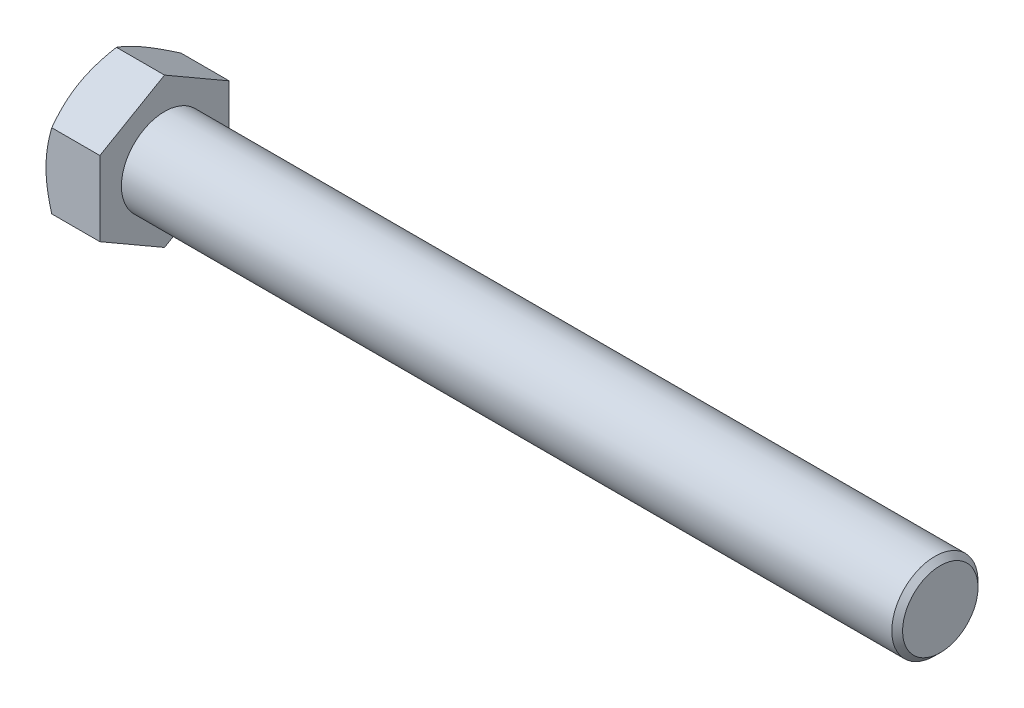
ISO-10303-21;
HEADER;
FILE_DESCRIPTION(('STEP AP214'),'2;1');
FILE_NAME('part.step','',(''),(''),'','','');
FILE_SCHEMA(('AUTOMOTIVE_DESIGN { 1 0 10303 214 1 1 1 1 }'));
ENDSEC;
DATA;
#1=APPLICATION_CONTEXT('core data for automotive mechanical design processes');
#2=APPLICATION_PROTOCOL_DEFINITION('international standard','automotive_design',2000,#1);
#3=PRODUCT_CONTEXT('',#1,'mechanical');
#4=PRODUCT('Part','Part','',(#3));
#5=PRODUCT_RELATED_PRODUCT_CATEGORY('part','',(#4));
#6=PRODUCT_DEFINITION_FORMATION('','',#4);
#7=PRODUCT_DEFINITION_CONTEXT('part definition',#1,'design');
#8=PRODUCT_DEFINITION('design','',#6,#7);
#9=PRODUCT_DEFINITION_SHAPE('','',#8);
#10=(LENGTH_UNIT() NAMED_UNIT(*) SI_UNIT(.MILLI.,.METRE.));
#11=(NAMED_UNIT(*) PLANE_ANGLE_UNIT() SI_UNIT($,.RADIAN.));
#12=(NAMED_UNIT(*) SI_UNIT($,.STERADIAN.) SOLID_ANGLE_UNIT());
#13=UNCERTAINTY_MEASURE_WITH_UNIT(LENGTH_MEASURE(1.E-05),#10,'distance_accuracy_value','');
#14=(GEOMETRIC_REPRESENTATION_CONTEXT(3) GLOBAL_UNCERTAINTY_ASSIGNED_CONTEXT((#13)) GLOBAL_UNIT_ASSIGNED_CONTEXT((#10,
#11,#12)) REPRESENTATION_CONTEXT('',''));
#15=CARTESIAN_POINT('',(0.,0.,0.));
#16=DIRECTION('',(0.,0.,1.));
#17=DIRECTION('',(1.,0.,0.));
#18=AXIS2_PLACEMENT_3D('',#15,#16,#17);
#19=CARTESIAN_POINT('',(180.,0.,0.));
#20=DIRECTION('',(-1.,0.,0.));
#21=DIRECTION('',(0.,0.,1.));
#22=AXIS2_PLACEMENT_3D('',#19,#20,#21);
#23=CYLINDRICAL_SURFACE('',#22,10.);
#24=CARTESIAN_POINT('',(178.75,0.,0.));
#25=DIRECTION('',(1.,0.,0.));
#26=DIRECTION('',(0.,0.,-1.));
#27=AXIS2_PLACEMENT_3D('',#24,#25,#26);
#28=CIRCLE('',#27,10.);
#29=CARTESIAN_POINT('',(178.75,0.,10.));
#30=VERTEX_POINT('',#29);
#31=EDGE_CURVE('E11',#30,#30,#28,.F.);
#32=CARTESIAN_POINT('',(0.,0.,0.));
#33=DIRECTION('',(-1.,0.,0.));
#34=DIRECTION('',(0.,0.,1.));
#35=AXIS2_PLACEMENT_3D('',#32,#33,#34);
#36=CIRCLE('',#35,10.);
#37=CARTESIAN_POINT('',(0.,0.,10.));
#38=VERTEX_POINT('',#37);
#39=EDGE_CURVE('E206',#38,#38,#36,.T.);
#40=CARTESIAN_POINT('',(178.75,0.,10.));
#41=CARTESIAN_POINT('',(176.888020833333,0.,10.));
#42=CARTESIAN_POINT('',(175.026041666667,0.,10.));
#43=CARTESIAN_POINT('',(171.302083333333,0.,10.));
#44=CARTESIAN_POINT('',(169.440104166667,0.,10.));
#45=CARTESIAN_POINT('',(165.716145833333,0.,10.));
#46=CARTESIAN_POINT('',(163.854166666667,0.,10.));
#47=CARTESIAN_POINT('',(160.130208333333,0.,10.));
#48=CARTESIAN_POINT('',(158.268229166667,0.,10.));
#49=CARTESIAN_POINT('',(154.544270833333,0.,10.));
#50=CARTESIAN_POINT('',(152.682291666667,0.,10.));
#51=CARTESIAN_POINT('',(148.958333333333,0.,10.));
#52=CARTESIAN_POINT('',(147.096354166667,0.,10.));
#53=CARTESIAN_POINT('',(143.372395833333,0.,10.));
#54=CARTESIAN_POINT('',(141.510416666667,0.,10.));
#55=CARTESIAN_POINT('',(137.786458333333,0.,10.));
#56=CARTESIAN_POINT('',(135.924479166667,0.,10.));
#57=CARTESIAN_POINT('',(132.200520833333,0.,10.));
#58=CARTESIAN_POINT('',(130.338541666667,0.,10.));
#59=CARTESIAN_POINT('',(126.614583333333,0.,10.));
#60=CARTESIAN_POINT('',(124.752604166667,0.,10.));
#61=CARTESIAN_POINT('',(121.028645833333,0.,10.));
#62=CARTESIAN_POINT('',(119.166666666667,0.,10.));
#63=CARTESIAN_POINT('',(115.442708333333,0.,10.));
#64=CARTESIAN_POINT('',(113.580729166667,0.,10.));
#65=CARTESIAN_POINT('',(109.856770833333,0.,10.));
#66=CARTESIAN_POINT('',(107.994791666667,0.,10.));
#67=CARTESIAN_POINT('',(104.270833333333,0.,10.));
#68=CARTESIAN_POINT('',(102.408854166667,0.,10.));
#69=CARTESIAN_POINT('',(98.6848958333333,0.,10.));
#70=CARTESIAN_POINT('',(96.8229166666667,0.,10.));
#71=CARTESIAN_POINT('',(93.0989583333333,0.,10.));
#72=CARTESIAN_POINT('',(91.2369791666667,0.,10.));
#73=CARTESIAN_POINT('',(87.5130208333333,0.,10.));
#74=CARTESIAN_POINT('',(85.6510416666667,0.,10.));
#75=CARTESIAN_POINT('',(81.9270833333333,0.,10.));
#76=CARTESIAN_POINT('',(80.0651041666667,0.,10.));
#77=CARTESIAN_POINT('',(76.3411458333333,0.,10.));
#78=CARTESIAN_POINT('',(74.4791666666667,0.,10.));
#79=CARTESIAN_POINT('',(70.7552083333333,0.,10.));
#80=CARTESIAN_POINT('',(68.8932291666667,0.,10.));
#81=CARTESIAN_POINT('',(65.1692708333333,0.,10.));
#82=CARTESIAN_POINT('',(63.3072916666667,0.,10.));
#83=CARTESIAN_POINT('',(59.5833333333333,0.,10.));
#84=CARTESIAN_POINT('',(57.7213541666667,0.,10.));
#85=CARTESIAN_POINT('',(53.9973958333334,0.,10.));
#86=CARTESIAN_POINT('',(52.1354166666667,0.,10.));
#87=CARTESIAN_POINT('',(48.4114583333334,0.,10.));
#88=CARTESIAN_POINT('',(46.5494791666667,0.,10.));
#89=CARTESIAN_POINT('',(42.8255208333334,0.,10.));
#90=CARTESIAN_POINT('',(40.9635416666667,0.,10.));
#91=CARTESIAN_POINT('',(37.2395833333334,0.,10.));
#92=CARTESIAN_POINT('',(35.3776041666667,0.,10.));
#93=CARTESIAN_POINT('',(31.6536458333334,0.,10.));
#94=CARTESIAN_POINT('',(29.7916666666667,0.,10.));
#95=CARTESIAN_POINT('',(26.0677083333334,0.,10.));
#96=CARTESIAN_POINT('',(24.2057291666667,0.,10.));
#97=CARTESIAN_POINT('',(20.4817708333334,0.,10.));
#98=CARTESIAN_POINT('',(18.6197916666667,0.,10.));
#99=CARTESIAN_POINT('',(14.8958333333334,0.,10.));
#100=CARTESIAN_POINT('',(13.0338541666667,0.,10.));
#101=CARTESIAN_POINT('',(9.30989583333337,0.,10.));
#102=CARTESIAN_POINT('',(7.44791666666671,0.,10.));
#103=CARTESIAN_POINT('',(3.72395833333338,0.,10.));
#104=CARTESIAN_POINT('',(1.8619791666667,0.,10.));
#105=CARTESIAN_POINT('',(0.,0.,10.));
#106=B_SPLINE_CURVE_WITH_KNOTS('',3,(#40,#41,#42,#43,#44,#45,#46,#47,#48,#49,#50,#51,#52,#53,
#54,#55,#56,#57,#58,#59,#60,#61,#62,#63,#64,#65,#66,#67,#68,#69,#70,#71,#72,#73,#74,#75,#76,#77,
#78,#79,#80,#81,#82,#83,#84,#85,#86,#87,#88,#89,#90,#91,#92,#93,#94,#95,#96,#97,#98,#99,#100,
#101,#102,#103,#104,#105),.UNSPECIFIED.,.F.,.F.,(4,2,2,2,2,2,2,2,2,2,2,2,2,2,2,2,2,2,2,2,2,2,2,
2,2,2,2,2,2,2,2,2,4),(0.,5.5859375,11.171875,16.7578125,22.34375,27.9296875,33.515625,
39.1015625,44.6875,50.2734375,55.859375,61.4453125,67.03125,72.6171875,78.203125,83.7890625,
89.375,94.9609375,100.546875,106.1328125,111.71875,117.3046875,122.890625,128.4765625,134.0625,
139.6484375,145.234375,150.8203125,156.40625,161.9921875,167.578125,173.1640625,178.75),.UNSPECIFIED.);
#107=EDGE_CURVE('BSEAM32',#30,#38,#106,.T.);
#108=ORIENTED_EDGE('',*,*,#31,.T.);
#109=ORIENTED_EDGE('',*,*,#39,.F.);
#110=ORIENTED_EDGE('',*,*,#107,.T.);
#111=ORIENTED_EDGE('',*,*,#107,.F.);
#112=EDGE_LOOP('',(#108,#110,#109,#111));
#113=FACE_BOUND('',#112,.T.);
#114=ADVANCED_FACE('F32',(#113),#23,.T.);
#115=CARTESIAN_POINT('',(180.,0.,0.));
#116=DIRECTION('',(1.,0.,0.));
#117=DIRECTION('',(0.,0.,-1.));
#118=AXIS2_PLACEMENT_3D('',#115,#116,#117);
#119=PLANE('',#118);
#120=CARTESIAN_POINT('',(180.,0.,0.));
#121=DIRECTION('',(1.,0.,0.));
#122=DIRECTION('',(0.,0.,-1.));
#123=AXIS2_PLACEMENT_3D('',#120,#121,#122);
#124=CIRCLE('',#123,8.74999999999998);
#125=CARTESIAN_POINT('',(180.,0.,-8.74999999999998));
#126=VERTEX_POINT('',#125);
#127=EDGE_CURVE('E39',#126,#126,#124,.T.);
#128=ORIENTED_EDGE('',*,*,#127,.T.);
#129=EDGE_LOOP('',(#128));
#130=FACE_BOUND('',#129,.T.);
#131=ADVANCED_FACE('F192',(#130),#119,.T.);
#132=CARTESIAN_POINT('',(0.,0.,30.));
#133=DIRECTION('',(-1.,0.,0.));
#134=DIRECTION('',(0.,0.,1.));
#135=AXIS2_PLACEMENT_3D('',#132,#133,#134);
#136=PLANE('',#135);
#137=DIRECTION('',(0.,0.5,0.866025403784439));
#138=VECTOR('',#137,1.);
#139=CARTESIAN_POINT('',(0.,-17.3205080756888,0.));
#140=LINE('',#139,#138);
#141=CARTESIAN_POINT('',(0.,-17.3205080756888,0.));
#142=VERTEX_POINT('',#141);
#143=CARTESIAN_POINT('',(0.,-8.66025403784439,15.));
#144=VERTEX_POINT('',#143);
#145=EDGE_CURVE('E233',#142,#144,#140,.T.);
#146=ORIENTED_EDGE('',*,*,#145,.F.);
#147=DIRECTION('',(0.,0.5,-0.866025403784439));
#148=VECTOR('',#147,1.);
#149=CARTESIAN_POINT('',(0.,-17.3205080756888,0.));
#150=LINE('',#149,#148);
#151=CARTESIAN_POINT('',(0.,-8.66025403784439,-15.));
#152=VERTEX_POINT('',#151);
#153=EDGE_CURVE('E220',#142,#152,#150,.T.);
#154=ORIENTED_EDGE('',*,*,#153,.T.);
#155=DIRECTION('',(0.,1.,0.));
#156=VECTOR('',#155,1.);
#157=CARTESIAN_POINT('',(0.,-8.66025403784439,-15.));
#158=LINE('',#157,#156);
#159=CARTESIAN_POINT('',(0.,8.66025403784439,-15.));
#160=VERTEX_POINT('',#159);
#161=EDGE_CURVE('E223',#152,#160,#158,.T.);
#162=ORIENTED_EDGE('',*,*,#161,.T.);
#163=DIRECTION('',(0.,0.5,0.866025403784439));
#164=VECTOR('',#163,1.);
#165=CARTESIAN_POINT('',(0.,8.66025403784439,-15.));
#166=LINE('',#165,#164);
#167=CARTESIAN_POINT('',(0.,17.3205080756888,0.));
#168=VERTEX_POINT('',#167);
#169=EDGE_CURVE('E226',#160,#168,#166,.T.);
#170=ORIENTED_EDGE('',*,*,#169,.T.);
#171=DIRECTION('',(0.,0.5,-0.866025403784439));
#172=VECTOR('',#171,1.);
#173=CARTESIAN_POINT('',(0.,8.66025403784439,15.));
#174=LINE('',#173,#172);
#175=CARTESIAN_POINT('',(0.,8.66025403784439,15.));
#176=VERTEX_POINT('',#175);
#177=EDGE_CURVE('E229',#176,#168,#174,.T.);
#178=ORIENTED_EDGE('',*,*,#177,.F.);
#179=DIRECTION('',(0.,1.,0.));
#180=VECTOR('',#179,1.);
#181=CARTESIAN_POINT('',(0.,-8.66025403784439,15.));
#182=LINE('',#181,#180);
#183=EDGE_CURVE('E231',#144,#176,#182,.T.);
#184=ORIENTED_EDGE('',*,*,#183,.F.);
#185=EDGE_LOOP('',(#146,#154,#162,#170,#178,#184));
#186=FACE_BOUND('',#185,.T.);
#187=ORIENTED_EDGE('',*,*,#39,.T.);
#188=EDGE_LOOP('',(#187));
#189=FACE_BOUND('',#188,.T.);
#190=ADVANCED_FACE('F163',(#186,#189),#136,.F.);
#191=CARTESIAN_POINT('',(-12.5,-17.3205080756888,0.));
#192=DIRECTION('',(0.,0.866025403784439,-0.5));
#193=DIRECTION('',(0.,0.5,0.866025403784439));
#194=AXIS2_PLACEMENT_3D('',#191,#192,#193);
#195=PLANE('',#194);
#196=CARTESIAN_POINT('',(-11.1601873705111,-17.3206235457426,-0.000200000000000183));
#197=CARTESIAN_POINT('',(-11.2700782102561,-17.130274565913,0.329494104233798));
#198=CARTESIAN_POINT('',(-11.3749824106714,-16.939183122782,0.660474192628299));
#199=CARTESIAN_POINT('',(-11.5734314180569,-16.5554679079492,1.32508844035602));
#200=CARTESIAN_POINT('',(-11.6669724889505,-16.3628436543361,1.6587234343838));
#201=CARTESIAN_POINT('',(-11.8414378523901,-15.9756905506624,2.32929228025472));
#202=CARTESIAN_POINT('',(-11.9223322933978,-15.7811583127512,2.66623200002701));
#203=CARTESIAN_POINT('',(-12.069767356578,-15.3907420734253,3.34245276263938));
#204=CARTESIAN_POINT('',(-12.1363087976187,-15.1948581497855,3.68173367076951));
#205=CARTESIAN_POINT('',(-12.2522076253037,-14.8067578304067,4.35394314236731));
#206=CARTESIAN_POINT('',(-12.3019486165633,-14.6145702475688,4.68682180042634));
#207=CARTESIAN_POINT('',(-12.3853532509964,-14.2293144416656,5.35410443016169));
#208=CARTESIAN_POINT('',(-12.4190165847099,-14.0362462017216,5.68850843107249));
#209=CARTESIAN_POINT('',(-12.4694159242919,-13.6497853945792,6.35787818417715));
#210=CARTESIAN_POINT('',(-12.486172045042,-13.4563934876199,6.69284279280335));
#211=CARTESIAN_POINT('',(-12.502396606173,-13.0694311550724,7.36308121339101));
#212=CARTESIAN_POINT('',(-12.5018655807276,-12.8758607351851,7.69835501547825));
#213=CARTESIAN_POINT('',(-12.4847233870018,-12.5139822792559,8.3251468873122));
#214=CARTESIAN_POINT('',(-12.470203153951,-12.3456484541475,8.61670962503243));
#215=CARTESIAN_POINT('',(-12.4283628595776,-12.0093680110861,9.19916443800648));
#216=CARTESIAN_POINT('',(-12.4010418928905,-11.8414214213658,9.49005646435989));
#217=CARTESIAN_POINT('',(-12.3340764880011,-11.5060066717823,10.0710118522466));
#218=CARTESIAN_POINT('',(-12.2944218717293,-11.338539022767,10.3610743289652));
#219=CARTESIAN_POINT('',(-12.2034848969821,-11.0043888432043,10.939839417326));
#220=CARTESIAN_POINT('',(-12.1522017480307,-10.8377063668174,11.2285419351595));
#221=CARTESIAN_POINT('',(-11.9796131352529,-10.3317324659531,12.1049144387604));
#222=CARTESIAN_POINT('',(-11.8410988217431,-9.99390625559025,12.6900465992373));
#223=CARTESIAN_POINT('',(-11.5267280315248,-9.3232912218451,13.8515859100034));
#224=CARTESIAN_POINT('',(-11.3509453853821,-8.99049381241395,14.4280079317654));
#225=CARTESIAN_POINT('',(-11.1601873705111,-8.66013856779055,15.0002));
#226=B_SPLINE_CURVE_WITH_KNOTS('',3,(#196,#197,#198,#199,#200,#201,#202,#203,#204,#205,#206,
#207,#208,#209,#210,#211,#212,#213,#214,#215,#216,#217,#218,#219,#220,#221,#222,#223,#224,#225),
.UNSPECIFIED.,.F.,.F.,(4,2,2,2,2,2,2,2,2,2,2,2,2,2,4),(0.,1.18875411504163,2.37789802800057,
3.56980778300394,4.76164951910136,5.92407379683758,7.08652044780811,8.24758247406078,
9.40860862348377,10.4193068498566,11.4300765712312,12.4416826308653,13.4533574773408,
15.5211962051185,17.5849760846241),.UNSPECIFIED.);
#227=CARTESIAN_POINT('',(-11.1602540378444,-17.3205080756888,0.));
#228=VERTEX_POINT('',#227);
#229=CARTESIAN_POINT('',(-12.5,-12.9903810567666,7.5));
#230=VERTEX_POINT('',#229);
#231=EDGE_CURVE('E180',#228,#230,#226,.T.);
#232=ORIENTED_EDGE('',*,*,#231,.F.);
#233=DIRECTION('',(1.,0.,0.));
#234=VECTOR('',#233,1.);
#235=CARTESIAN_POINT('',(-12.5,-17.3205080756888,0.));
#236=LINE('',#235,#234);
#237=EDGE_CURVE('E218',#228,#142,#236,.T.);
#238=ORIENTED_EDGE('',*,*,#237,.T.);
#239=ORIENTED_EDGE('',*,*,#145,.T.);
#240=DIRECTION('',(1.,0.,0.));
#241=VECTOR('',#240,1.);
#242=CARTESIAN_POINT('',(-12.5,-8.66025403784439,15.));
#243=LINE('',#242,#241);
#244=CARTESIAN_POINT('',(-11.1602540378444,-8.66025403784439,15.));
#245=VERTEX_POINT('',#244);
#246=EDGE_CURVE('E209',#245,#144,#243,.T.);
#247=ORIENTED_EDGE('',*,*,#246,.F.);
#248=EDGE_CURVE('E134',#230,#245,#226,.T.);
#249=ORIENTED_EDGE('',*,*,#248,.F.);
#250=EDGE_LOOP('',(#232,#238,#239,#247,#249));
#251=FACE_BOUND('',#250,.T.);
#252=ADVANCED_FACE('F186',(#251),#195,.F.);
#253=CARTESIAN_POINT('',(-12.5,-8.66025403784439,15.));
#254=DIRECTION('',(0.,0.,-1.));
#255=DIRECTION('',(-1.,0.,0.));
#256=AXIS2_PLACEMENT_3D('',#253,#254,#255);
#257=PLANE('',#256);
#258=CARTESIAN_POINT('',(-4.98802951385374,-23.6563424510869,15.));
#259=CARTESIAN_POINT('',(-5.14859323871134,-23.3270368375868,15.));
#260=CARTESIAN_POINT('',(-5.30838548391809,-22.9973552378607,15.));
#261=CARTESIAN_POINT('',(-5.62625300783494,-22.3371617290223,15.));
#262=CARTESIAN_POINT('',(-5.78432827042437,-22.0066498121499,15.));
#263=CARTESIAN_POINT('',(-6.25575678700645,-21.0136682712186,15.));
#264=CARTESIAN_POINT('',(-6.56626799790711,-20.3498444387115,15.));
#265=CARTESIAN_POINT('',(-7.17949488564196,-19.0144565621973,15.));
#266=CARTESIAN_POINT('',(-7.48216221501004,-18.3428702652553,15.));
#267=CARTESIAN_POINT('',(-8.07562821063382,-16.9944919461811,15.));
#268=CARTESIAN_POINT('',(-8.36642741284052,-16.3177001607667,15.));
#269=CARTESIAN_POINT('',(-8.94267079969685,-14.9346939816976,15.));
#270=CARTESIAN_POINT('',(-9.22759584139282,-14.2282621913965,15.));
#271=CARTESIAN_POINT('',(-9.77682099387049,-12.8072761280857,15.));
#272=CARTESIAN_POINT('',(-10.041118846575,-12.0927209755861,15.));
#273=CARTESIAN_POINT('',(-10.5424349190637,-10.6555877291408,15.));
#274=CARTESIAN_POINT('',(-10.7795050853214,-9.93302789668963,15.));
#275=CARTESIAN_POINT('',(-11.2190363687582,-8.47748492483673,15.));
#276=CARTESIAN_POINT('',(-11.4215079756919,-7.74450501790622,15.));
#277=CARTESIAN_POINT('',(-11.691591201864,-6.63906626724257,15.));
#278=CARTESIAN_POINT('',(-11.7758229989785,-6.27064605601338,15.));
#279=CARTESIAN_POINT('',(-11.9321086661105,-5.53121828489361,15.));
#280=CARTESIAN_POINT('',(-12.0041627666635,-5.16021077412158,15.));
#281=CARTESIAN_POINT('',(-12.1348466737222,-4.41583632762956,15.));
#282=CARTESIAN_POINT('',(-12.1934768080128,-4.04246944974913,15.));
#283=CARTESIAN_POINT('',(-12.2961594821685,-3.29373978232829,15.));
#284=CARTESIAN_POINT('',(-12.3402126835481,-2.91837708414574,15.));
#285=CARTESIAN_POINT('',(-12.4122914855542,-2.17125057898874,15.));
#286=CARTESIAN_POINT('',(-12.4405265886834,-1.79950710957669,15.));
#287=CARTESIAN_POINT('',(-12.4812352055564,-1.0551586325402,15.));
#288=CARTESIAN_POINT('',(-12.4937089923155,-0.682553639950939,15.));
#289=CARTESIAN_POINT('',(-12.5025960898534,0.0628536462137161,15.));
#290=CARTESIAN_POINT('',(-12.4990093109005,0.435655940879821,15.));
#291=CARTESIAN_POINT('',(-12.4758669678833,1.18076829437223,15.));
#292=CARTESIAN_POINT('',(-12.456310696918,1.55307833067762,15.));
#293=CARTESIAN_POINT('',(-12.3914173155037,2.43604587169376,15.));
#294=CARTESIAN_POINT('',(-12.3391608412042,2.94620665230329,15.));
#295=CARTESIAN_POINT('',(-12.2074265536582,3.96297341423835,15.));
#296=CARTESIAN_POINT('',(-12.1279453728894,4.46957894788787,15.));
#297=CARTESIAN_POINT('',(-11.8528606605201,5.98333889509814,15.));
#298=CARTESIAN_POINT('',(-11.6206572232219,6.98394325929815,15.));
#299=CARTESIAN_POINT('',(-11.2149672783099,8.48096930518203,15.));
#300=CARTESIAN_POINT('',(-11.0681521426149,8.98506717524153,15.));
#301=CARTESIAN_POINT('',(-10.7585239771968,9.98837333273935,15.));
#302=CARTESIAN_POINT('',(-10.5957108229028,10.4875815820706,15.));
#303=CARTESIAN_POINT('',(-10.2567587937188,11.4812605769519,15.));
#304=CARTESIAN_POINT('',(-10.0806236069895,11.9757325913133,15.));
#305=CARTESIAN_POINT('',(-9.80804005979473,12.7143247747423,15.));
#306=CARTESIAN_POINT('',(-9.71578264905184,12.9600014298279,15.));
#307=CARTESIAN_POINT('',(-9.52870505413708,13.4503781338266,15.));
#308=CARTESIAN_POINT('',(-9.43388486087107,13.6950781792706,15.));
#309=CARTESIAN_POINT('',(-9.17279784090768,14.3593902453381,15.));
#310=CARTESIAN_POINT('',(-9.00423842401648,14.7781022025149,15.));
#311=CARTESIAN_POINT('',(-8.66115582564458,15.6130793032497,15.));
#312=CARTESIAN_POINT('',(-8.48663249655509,16.0293443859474,15.));
#313=CARTESIAN_POINT('',(-7.95534410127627,17.2749256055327,15.));
#314=CARTESIAN_POINT('',(-7.59088627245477,18.1009632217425,15.));
#315=CARTESIAN_POINT('',(-6.84641952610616,19.7463472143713,15.));
#316=CARTESIAN_POINT('',(-6.46640450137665,20.5656908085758,15.));
#317=CARTESIAN_POINT('',(-5.6945498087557,22.1987342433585,15.));
#318=CARTESIAN_POINT('',(-5.30271064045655,23.0124343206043,15.));
#319=CARTESIAN_POINT('',(-4.50915614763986,24.6366504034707,15.));
#320=CARTESIAN_POINT('',(-4.10742564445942,25.4471589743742,15.));
#321=CARTESIAN_POINT('',(-3.29663533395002,27.0645048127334,15.));
#322=CARTESIAN_POINT('',(-2.88757546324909,27.8713420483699,15.));
#323=CARTESIAN_POINT('',(-2.06366878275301,29.4818238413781,15.));
#324=CARTESIAN_POINT('',(-1.64882329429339,30.2854690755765,15.));
#325=CARTESIAN_POINT('',(-0.814347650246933,31.8902654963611,15.));
#326=CARTESIAN_POINT('',(-0.394717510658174,32.6914166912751,15.));
#327=CARTESIAN_POINT('',(0.779727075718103,34.920349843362,15.));
#328=CARTESIAN_POINT('',(1.53883048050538,36.3458714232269,15.));
#329=CARTESIAN_POINT('',(3.06610948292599,39.1921522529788,15.));
#330=CARTESIAN_POINT('',(3.8342856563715,40.6129111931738,15.));
#331=CARTESIAN_POINT('',(5.37475686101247,43.4459001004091,15.));
#332=CARTESIAN_POINT('',(6.14702882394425,44.8581426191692,15.));
#333=CARTESIAN_POINT('',(7.30926449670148,46.9743278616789,15.));
#334=CARTESIAN_POINT('',(7.69729873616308,47.6793316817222,15.));
#335=CARTESIAN_POINT('',(8.47451029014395,49.0887078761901,15.));
#336=CARTESIAN_POINT('',(8.86368760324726,49.7930802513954,15.));
#337=CARTESIAN_POINT('',(9.25336545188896,50.4971756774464,15.));
#338=B_SPLINE_CURVE_WITH_KNOTS('',3,(#258,#259,#260,#261,#262,#263,#264,#265,#266,#267,#268,
#269,#270,#271,#272,#273,#274,#275,#276,#277,#278,#279,#280,#281,#282,#283,#284,#285,#286,#287,
#288,#289,#290,#291,#292,#293,#294,#295,#296,#297,#298,#299,#300,#301,#302,#303,#304,#305,#306,
#307,#308,#309,#310,#311,#312,#313,#314,#315,#316,#317,#318,#319,#320,#321,#322,#323,#324,#325,
#326,#327,#328,#329,#330,#331,#332,#333,#334,#335,#336,#337),.UNSPECIFIED.,.F.,.F.,(4,2,2,2,2,2,
2,2,2,2,2,2,2,2,2,2,2,2,2,2,2,2,2,2,2,2,2,2,2,2,2,2,2,2,2,2,2,2,2,4),(0.,1.09909142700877,
2.19819316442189,4.39670244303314,6.60652703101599,8.81625171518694,11.1011868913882,
13.3863718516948,15.6671219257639,17.9471792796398,19.0807901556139,20.2143795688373,
21.3479412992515,22.4814515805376,23.5995709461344,24.7176709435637,25.8357771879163,
26.9539329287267,28.4915630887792,30.0293835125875,33.1065029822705,34.6814865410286,
36.2564823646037,37.8310437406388,38.618315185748,39.4055894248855,40.7596309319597,
42.1137059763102,44.8220642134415,47.531496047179,50.2408135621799,52.9545856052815,
55.6683811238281,58.3815666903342,61.0947431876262,65.939807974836,70.7851819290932,
75.6139863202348,78.0281952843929,80.4424012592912),.UNSPECIFIED.);
#339=CARTESIAN_POINT('',(-12.5,0.,15.));
#340=VERTEX_POINT('',#339);
#341=EDGE_CURVE('E235',#245,#340,#338,.T.);
#342=ORIENTED_EDGE('',*,*,#341,.F.);
#343=ORIENTED_EDGE('',*,*,#246,.T.);
#344=ORIENTED_EDGE('',*,*,#183,.T.);
#345=DIRECTION('',(1.,0.,0.));
#346=VECTOR('',#345,1.);
#347=CARTESIAN_POINT('',(-12.5,8.66025403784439,15.));
#348=LINE('',#347,#346);
#349=CARTESIAN_POINT('',(-11.1602540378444,8.66025403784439,15.));
#350=VERTEX_POINT('',#349);
#351=EDGE_CURVE('E211',#350,#176,#348,.T.);
#352=ORIENTED_EDGE('',*,*,#351,.F.);
#353=EDGE_CURVE('E105',#340,#350,#338,.T.);
#354=ORIENTED_EDGE('',*,*,#353,.F.);
#355=EDGE_LOOP('',(#342,#343,#344,#352,#354));
#356=FACE_BOUND('',#355,.T.);
#357=ADVANCED_FACE('F189',(#356),#257,.F.);
#358=CARTESIAN_POINT('',(-12.5,8.66025403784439,15.));
#359=DIRECTION('',(0.,-0.866025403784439,-0.5));
#360=DIRECTION('',(0.,0.5,-0.866025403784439));
#361=AXIS2_PLACEMENT_3D('',#358,#359,#360);
#362=PLANE('',#361);
#363=CARTESIAN_POINT('',(-11.1601873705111,8.66013856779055,15.0002));
#364=CARTESIAN_POINT('',(-11.2700782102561,8.85048754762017,14.6705058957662));
#365=CARTESIAN_POINT('',(-11.3749824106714,9.04157899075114,14.3395258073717));
#366=CARTESIAN_POINT('',(-11.5734314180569,9.425294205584,13.674911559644));
#367=CARTESIAN_POINT('',(-11.6669724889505,9.61791845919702,13.3412765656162));
#368=CARTESIAN_POINT('',(-11.8414378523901,10.0050715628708,12.6707077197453));
#369=CARTESIAN_POINT('',(-11.9223322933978,10.199603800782,12.333767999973));
#370=CARTESIAN_POINT('',(-12.069767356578,10.5900200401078,11.6575472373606));
#371=CARTESIAN_POINT('',(-12.1363087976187,10.7859039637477,11.3182663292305));
#372=CARTESIAN_POINT('',(-12.2522076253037,11.1740042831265,10.6460568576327));
#373=CARTESIAN_POINT('',(-12.3019486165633,11.3661918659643,10.3131781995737));
#374=CARTESIAN_POINT('',(-12.3853532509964,11.7514476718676,9.6458955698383));
#375=CARTESIAN_POINT('',(-12.4190165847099,11.9445159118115,9.3114915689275));
#376=CARTESIAN_POINT('',(-12.4694159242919,12.3309767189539,8.64212181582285));
#377=CARTESIAN_POINT('',(-12.486172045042,12.5243686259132,8.30715720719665));
#378=CARTESIAN_POINT('',(-12.502396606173,12.9113309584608,7.63691878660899));
#379=CARTESIAN_POINT('',(-12.5018655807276,13.1049013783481,7.30164498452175));
#380=CARTESIAN_POINT('',(-12.4847233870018,13.4667798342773,6.67485311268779));
#381=CARTESIAN_POINT('',(-12.470203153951,13.6351136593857,6.38329037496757));
#382=CARTESIAN_POINT('',(-12.4283628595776,13.9713941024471,5.80083556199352));
#383=CARTESIAN_POINT('',(-12.4010418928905,14.1393406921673,5.50994353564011));
#384=CARTESIAN_POINT('',(-12.3340764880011,14.4747554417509,4.92898814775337));
#385=CARTESIAN_POINT('',(-12.2944218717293,14.6422230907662,4.63892567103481));
#386=CARTESIAN_POINT('',(-12.2034848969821,14.9763732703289,4.06016058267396));
#387=CARTESIAN_POINT('',(-12.1522017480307,15.1430557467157,3.77145806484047));
#388=CARTESIAN_POINT('',(-11.9796131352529,15.6490296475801,2.89508556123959));
#389=CARTESIAN_POINT('',(-11.8410988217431,15.9868558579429,2.30995340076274));
#390=CARTESIAN_POINT('',(-11.5267280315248,16.6574708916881,1.14841408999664));
#391=CARTESIAN_POINT('',(-11.3509453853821,16.9902683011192,0.571992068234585));
#392=CARTESIAN_POINT('',(-11.1601873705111,17.3206235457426,-0.000200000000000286));
#393=B_SPLINE_CURVE_WITH_KNOTS('',3,(#363,#364,#365,#366,#367,#368,#369,#370,#371,#372,#373,
#374,#375,#376,#377,#378,#379,#380,#381,#382,#383,#384,#385,#386,#387,#388,#389,#390,#391,#392),
.UNSPECIFIED.,.F.,.F.,(4,2,2,2,2,2,2,2,2,2,2,2,2,2,4),(0.,1.18875411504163,2.37789802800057,
3.56980778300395,4.76164951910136,5.92407379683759,7.08652044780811,8.24758247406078,
9.40860862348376,10.4193068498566,11.4300765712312,12.4416826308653,13.4533574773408,
15.5211962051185,17.5849760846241),.UNSPECIFIED.);
#394=CARTESIAN_POINT('',(-12.5,12.9903810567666,7.5));
#395=VERTEX_POINT('',#394);
#396=EDGE_CURVE('E101',#350,#395,#393,.T.);
#397=ORIENTED_EDGE('',*,*,#396,.F.);
#398=ORIENTED_EDGE('',*,*,#351,.T.);
#399=ORIENTED_EDGE('',*,*,#177,.T.);
#400=DIRECTION('',(1.,0.,0.));
#401=VECTOR('',#400,1.);
#402=CARTESIAN_POINT('',(-12.5,17.3205080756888,0.));
#403=LINE('',#402,#401);
#404=CARTESIAN_POINT('',(-11.1602540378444,17.3205080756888,0.));
#405=VERTEX_POINT('',#404);
#406=EDGE_CURVE('E133',#405,#168,#403,.T.);
#407=ORIENTED_EDGE('',*,*,#406,.F.);
#408=EDGE_CURVE('E109',#395,#405,#393,.T.);
#409=ORIENTED_EDGE('',*,*,#408,.F.);
#410=EDGE_LOOP('',(#397,#398,#399,#407,#409));
#411=FACE_BOUND('',#410,.T.);
#412=ADVANCED_FACE('F131',(#411),#362,.F.);
#413=CARTESIAN_POINT('',(-12.5,8.66025403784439,-15.));
#414=DIRECTION('',(0.,0.866025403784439,-0.5));
#415=DIRECTION('',(0.,0.5,0.866025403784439));
#416=AXIS2_PLACEMENT_3D('',#413,#414,#415);
#417=PLANE('',#416);
#418=DIRECTION('',(1.,0.,0.));
#419=VECTOR('',#418,1.);
#420=CARTESIAN_POINT('',(-12.5,8.66025403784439,-15.));
#421=LINE('',#420,#419);
#422=CARTESIAN_POINT('',(-11.1602540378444,8.66025403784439,-15.));
#423=VERTEX_POINT('',#422);
#424=EDGE_CURVE('E214',#423,#160,#421,.T.);
#425=ORIENTED_EDGE('',*,*,#424,.F.);
#426=CARTESIAN_POINT('',(-11.1601873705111,8.66013856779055,-15.0002));
#427=CARTESIAN_POINT('',(-11.2700782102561,8.85048754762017,-14.6705058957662));
#428=CARTESIAN_POINT('',(-11.3749824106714,9.04157899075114,-14.3395258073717));
#429=CARTESIAN_POINT('',(-11.5734314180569,9.425294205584,-13.674911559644));
#430=CARTESIAN_POINT('',(-11.6669724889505,9.61791845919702,-13.3412765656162));
#431=CARTESIAN_POINT('',(-11.8414378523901,10.0050715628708,-12.6707077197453));
#432=CARTESIAN_POINT('',(-11.9223322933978,10.199603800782,-12.333767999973));
#433=CARTESIAN_POINT('',(-12.069767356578,10.5900200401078,-11.6575472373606));
#434=CARTESIAN_POINT('',(-12.1363087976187,10.7859039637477,-11.3182663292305));
#435=CARTESIAN_POINT('',(-12.2522076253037,11.1740042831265,-10.6460568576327));
#436=CARTESIAN_POINT('',(-12.3019486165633,11.3661918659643,-10.3131781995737));
#437=CARTESIAN_POINT('',(-12.3853532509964,11.7514476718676,-9.6458955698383));
#438=CARTESIAN_POINT('',(-12.4190165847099,11.9445159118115,-9.3114915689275));
#439=CARTESIAN_POINT('',(-12.4694159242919,12.3309767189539,-8.64212181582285));
#440=CARTESIAN_POINT('',(-12.486172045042,12.5243686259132,-8.30715720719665));
#441=CARTESIAN_POINT('',(-12.502396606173,12.9113309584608,-7.63691878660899));
#442=CARTESIAN_POINT('',(-12.5018655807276,13.1049013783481,-7.30164498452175));
#443=CARTESIAN_POINT('',(-12.4847233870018,13.4667798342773,-6.67485311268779));
#444=CARTESIAN_POINT('',(-12.470203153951,13.6351136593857,-6.38329037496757));
#445=CARTESIAN_POINT('',(-12.4283628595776,13.9713941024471,-5.80083556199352));
#446=CARTESIAN_POINT('',(-12.4010418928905,14.1393406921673,-5.50994353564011));
#447=CARTESIAN_POINT('',(-12.3340764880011,14.4747554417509,-4.92898814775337));
#448=CARTESIAN_POINT('',(-12.2944218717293,14.6422230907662,-4.63892567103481));
#449=CARTESIAN_POINT('',(-12.2034848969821,14.9763732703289,-4.06016058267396));
#450=CARTESIAN_POINT('',(-12.1522017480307,15.1430557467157,-3.77145806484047));
#451=CARTESIAN_POINT('',(-11.9796131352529,15.6490296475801,-2.89508556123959));
#452=CARTESIAN_POINT('',(-11.8410988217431,15.9868558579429,-2.30995340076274));
#453=CARTESIAN_POINT('',(-11.5267280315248,16.6574708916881,-1.14841408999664));
#454=CARTESIAN_POINT('',(-11.3509453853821,16.9902683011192,-0.571992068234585));
#455=CARTESIAN_POINT('',(-11.1601873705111,17.3206235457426,0.000200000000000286));
#456=B_SPLINE_CURVE_WITH_KNOTS('',3,(#426,#427,#428,#429,#430,#431,#432,#433,#434,#435,#436,
#437,#438,#439,#440,#441,#442,#443,#444,#445,#446,#447,#448,#449,#450,#451,#452,#453,#454,#455),
.UNSPECIFIED.,.F.,.F.,(4,2,2,2,2,2,2,2,2,2,2,2,2,2,4),(0.,1.18875411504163,2.37789802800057,
3.56980778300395,4.76164951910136,5.92407379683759,7.08652044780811,8.24758247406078,
9.40860862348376,10.4193068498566,11.4300765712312,12.4416826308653,13.4533574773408,
15.5211962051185,17.5849760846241),.UNSPECIFIED.);
#457=CARTESIAN_POINT('',(-12.5,12.9903810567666,-7.5));
#458=VERTEX_POINT('',#457);
#459=EDGE_CURVE('E136',#423,#458,#456,.T.);
#460=ORIENTED_EDGE('',*,*,#459,.T.);
#461=EDGE_CURVE('E116',#458,#405,#456,.T.);
#462=ORIENTED_EDGE('',*,*,#461,.T.);
#463=ORIENTED_EDGE('',*,*,#406,.T.);
#464=ORIENTED_EDGE('',*,*,#169,.F.);
#465=EDGE_LOOP('',(#425,#460,#462,#463,#464));
#466=FACE_BOUND('',#465,.T.);
#467=ADVANCED_FACE('F261',(#466),#417,.T.);
#468=CARTESIAN_POINT('',(-12.5,-8.66025403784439,-15.));
#469=DIRECTION('',(0.,0.,-1.));
#470=DIRECTION('',(-1.,0.,0.));
#471=AXIS2_PLACEMENT_3D('',#468,#469,#470);
#472=PLANE('',#471);
#473=DIRECTION('',(1.,0.,0.));
#474=VECTOR('',#473,1.);
#475=CARTESIAN_POINT('',(-12.5,-8.66025403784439,-15.));
#476=LINE('',#475,#474);
#477=CARTESIAN_POINT('',(-11.1602540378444,-8.66025403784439,-15.));
#478=VERTEX_POINT('',#477);
#479=EDGE_CURVE('E216',#478,#152,#476,.T.);
#480=ORIENTED_EDGE('',*,*,#479,.F.);
#481=CARTESIAN_POINT('',(-4.98802951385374,-23.6563424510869,-15.));
#482=CARTESIAN_POINT('',(-5.14859323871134,-23.3270368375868,-15.));
#483=CARTESIAN_POINT('',(-5.30838548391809,-22.9973552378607,-15.));
#484=CARTESIAN_POINT('',(-5.62625300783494,-22.3371617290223,-15.));
#485=CARTESIAN_POINT('',(-5.78432827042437,-22.0066498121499,-15.));
#486=CARTESIAN_POINT('',(-6.25575678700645,-21.0136682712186,-15.));
#487=CARTESIAN_POINT('',(-6.56626799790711,-20.3498444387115,-15.));
#488=CARTESIAN_POINT('',(-7.17949488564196,-19.0144565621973,-15.));
#489=CARTESIAN_POINT('',(-7.48216221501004,-18.3428702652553,-15.));
#490=CARTESIAN_POINT('',(-8.07562821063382,-16.9944919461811,-15.));
#491=CARTESIAN_POINT('',(-8.36642741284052,-16.3177001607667,-15.));
#492=CARTESIAN_POINT('',(-8.94267079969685,-14.9346939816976,-15.));
#493=CARTESIAN_POINT('',(-9.22759584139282,-14.2282621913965,-15.));
#494=CARTESIAN_POINT('',(-9.77682099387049,-12.8072761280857,-15.));
#495=CARTESIAN_POINT('',(-10.041118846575,-12.0927209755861,-15.));
#496=CARTESIAN_POINT('',(-10.5424349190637,-10.6555877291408,-15.));
#497=CARTESIAN_POINT('',(-10.7795050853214,-9.93302789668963,-15.));
#498=CARTESIAN_POINT('',(-11.2190363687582,-8.47748492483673,-15.));
#499=CARTESIAN_POINT('',(-11.4215079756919,-7.74450501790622,-15.));
#500=CARTESIAN_POINT('',(-11.691591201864,-6.63906626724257,-15.));
#501=CARTESIAN_POINT('',(-11.7758229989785,-6.27064605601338,-15.));
#502=CARTESIAN_POINT('',(-11.9321086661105,-5.53121828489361,-15.));
#503=CARTESIAN_POINT('',(-12.0041627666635,-5.16021077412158,-15.));
#504=CARTESIAN_POINT('',(-12.1348466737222,-4.41583632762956,-15.));
#505=CARTESIAN_POINT('',(-12.1934768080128,-4.04246944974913,-15.));
#506=CARTESIAN_POINT('',(-12.2961594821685,-3.29373978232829,-15.));
#507=CARTESIAN_POINT('',(-12.3402126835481,-2.91837708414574,-15.));
#508=CARTESIAN_POINT('',(-12.4122914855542,-2.17125057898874,-15.));
#509=CARTESIAN_POINT('',(-12.4405265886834,-1.79950710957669,-15.));
#510=CARTESIAN_POINT('',(-12.4812352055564,-1.0551586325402,-15.));
#511=CARTESIAN_POINT('',(-12.4937089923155,-0.682553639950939,-15.));
#512=CARTESIAN_POINT('',(-12.5025960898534,0.0628536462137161,-15.));
#513=CARTESIAN_POINT('',(-12.4990093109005,0.435655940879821,-15.));
#514=CARTESIAN_POINT('',(-12.4758669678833,1.18076829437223,-15.));
#515=CARTESIAN_POINT('',(-12.456310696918,1.55307833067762,-15.));
#516=CARTESIAN_POINT('',(-12.3914173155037,2.43604587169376,-15.));
#517=CARTESIAN_POINT('',(-12.3391608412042,2.94620665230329,-15.));
#518=CARTESIAN_POINT('',(-12.2074265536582,3.96297341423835,-15.));
#519=CARTESIAN_POINT('',(-12.1279453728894,4.46957894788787,-15.));
#520=CARTESIAN_POINT('',(-11.8528606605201,5.98333889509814,-15.));
#521=CARTESIAN_POINT('',(-11.6206572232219,6.98394325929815,-15.));
#522=CARTESIAN_POINT('',(-11.2149672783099,8.48096930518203,-15.));
#523=CARTESIAN_POINT('',(-11.0681521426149,8.98506717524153,-15.));
#524=CARTESIAN_POINT('',(-10.7585239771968,9.98837333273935,-15.));
#525=CARTESIAN_POINT('',(-10.5957108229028,10.4875815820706,-15.));
#526=CARTESIAN_POINT('',(-10.2567587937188,11.4812605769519,-15.));
#527=CARTESIAN_POINT('',(-10.0806236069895,11.9757325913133,-15.));
#528=CARTESIAN_POINT('',(-9.80804005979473,12.7143247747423,-15.));
#529=CARTESIAN_POINT('',(-9.71578264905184,12.9600014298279,-15.));
#530=CARTESIAN_POINT('',(-9.52870505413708,13.4503781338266,-15.));
#531=CARTESIAN_POINT('',(-9.43388486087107,13.6950781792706,-15.));
#532=CARTESIAN_POINT('',(-9.17279784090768,14.3593902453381,-15.));
#533=CARTESIAN_POINT('',(-9.00423842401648,14.7781022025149,-15.));
#534=CARTESIAN_POINT('',(-8.66115582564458,15.6130793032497,-15.));
#535=CARTESIAN_POINT('',(-8.48663249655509,16.0293443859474,-15.));
#536=CARTESIAN_POINT('',(-7.95534410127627,17.2749256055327,-15.));
#537=CARTESIAN_POINT('',(-7.59088627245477,18.1009632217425,-15.));
#538=CARTESIAN_POINT('',(-6.84641952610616,19.7463472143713,-15.));
#539=CARTESIAN_POINT('',(-6.46640450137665,20.5656908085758,-15.));
#540=CARTESIAN_POINT('',(-5.6945498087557,22.1987342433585,-15.));
#541=CARTESIAN_POINT('',(-5.30271064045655,23.0124343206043,-15.));
#542=CARTESIAN_POINT('',(-4.50915614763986,24.6366504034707,-15.));
#543=CARTESIAN_POINT('',(-4.10742564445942,25.4471589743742,-15.));
#544=CARTESIAN_POINT('',(-3.29663533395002,27.0645048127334,-15.));
#545=CARTESIAN_POINT('',(-2.88757546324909,27.8713420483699,-15.));
#546=CARTESIAN_POINT('',(-2.06366878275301,29.4818238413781,-15.));
#547=CARTESIAN_POINT('',(-1.64882329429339,30.2854690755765,-15.));
#548=CARTESIAN_POINT('',(-0.814347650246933,31.8902654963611,-15.));
#549=CARTESIAN_POINT('',(-0.394717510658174,32.6914166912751,-15.));
#550=CARTESIAN_POINT('',(0.779727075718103,34.920349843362,-15.));
#551=CARTESIAN_POINT('',(1.53883048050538,36.3458714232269,-15.));
#552=CARTESIAN_POINT('',(3.06610948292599,39.1921522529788,-15.));
#553=CARTESIAN_POINT('',(3.8342856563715,40.6129111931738,-15.));
#554=CARTESIAN_POINT('',(5.37475686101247,43.4459001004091,-15.));
#555=CARTESIAN_POINT('',(6.14702882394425,44.8581426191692,-15.));
#556=CARTESIAN_POINT('',(7.30926449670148,46.9743278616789,-15.));
#557=CARTESIAN_POINT('',(7.69729873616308,47.6793316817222,-15.));
#558=CARTESIAN_POINT('',(8.47451029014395,49.0887078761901,-15.));
#559=CARTESIAN_POINT('',(8.86368760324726,49.7930802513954,-15.));
#560=CARTESIAN_POINT('',(9.25336545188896,50.4971756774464,-15.));
#561=B_SPLINE_CURVE_WITH_KNOTS('',3,(#481,#482,#483,#484,#485,#486,#487,#488,#489,#490,#491,
#492,#493,#494,#495,#496,#497,#498,#499,#500,#501,#502,#503,#504,#505,#506,#507,#508,#509,#510,
#511,#512,#513,#514,#515,#516,#517,#518,#519,#520,#521,#522,#523,#524,#525,#526,#527,#528,#529,
#530,#531,#532,#533,#534,#535,#536,#537,#538,#539,#540,#541,#542,#543,#544,#545,#546,#547,#548,
#549,#550,#551,#552,#553,#554,#555,#556,#557,#558,#559,#560),.UNSPECIFIED.,.F.,.F.,(4,2,2,2,2,2,
2,2,2,2,2,2,2,2,2,2,2,2,2,2,2,2,2,2,2,2,2,2,2,2,2,2,2,2,2,2,2,2,2,4),(0.,1.09909142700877,
2.19819316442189,4.39670244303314,6.60652703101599,8.81625171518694,11.1011868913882,
13.3863718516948,15.6671219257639,17.9471792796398,19.0807901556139,20.2143795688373,
21.3479412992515,22.4814515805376,23.5995709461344,24.7176709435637,25.8357771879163,
26.9539329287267,28.4915630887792,30.0293835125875,33.1065029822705,34.6814865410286,
36.2564823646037,37.8310437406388,38.618315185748,39.4055894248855,40.7596309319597,
42.1137059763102,44.8220642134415,47.531496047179,50.2408135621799,52.9545856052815,
55.6683811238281,58.3815666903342,61.0947431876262,65.939807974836,70.7851819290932,
75.6139863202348,78.0281952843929,80.4424012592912),.UNSPECIFIED.);
#562=CARTESIAN_POINT('',(-12.5,0.,-15.));
#563=VERTEX_POINT('',#562);
#564=EDGE_CURVE('E54',#478,#563,#561,.T.);
#565=ORIENTED_EDGE('',*,*,#564,.T.);
#566=EDGE_CURVE('E185',#563,#423,#561,.T.);
#567=ORIENTED_EDGE('',*,*,#566,.T.);
#568=ORIENTED_EDGE('',*,*,#424,.T.);
#569=ORIENTED_EDGE('',*,*,#161,.F.);
#570=EDGE_LOOP('',(#480,#565,#567,#568,#569));
#571=FACE_BOUND('',#570,.T.);
#572=ADVANCED_FACE('F257',(#571),#472,.T.);
#573=CARTESIAN_POINT('',(-12.5,-17.3205080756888,0.));
#574=DIRECTION('',(0.,-0.866025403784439,-0.5));
#575=DIRECTION('',(0.,0.5,-0.866025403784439));
#576=AXIS2_PLACEMENT_3D('',#573,#574,#575);
#577=PLANE('',#576);
#578=ORIENTED_EDGE('',*,*,#237,.F.);
#579=CARTESIAN_POINT('',(-11.1601873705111,-17.3206235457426,0.000200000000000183));
#580=CARTESIAN_POINT('',(-11.2700782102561,-17.130274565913,-0.329494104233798));
#581=CARTESIAN_POINT('',(-11.3749824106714,-16.939183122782,-0.660474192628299));
#582=CARTESIAN_POINT('',(-11.5734314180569,-16.5554679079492,-1.32508844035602));
#583=CARTESIAN_POINT('',(-11.6669724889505,-16.3628436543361,-1.6587234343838));
#584=CARTESIAN_POINT('',(-11.8414378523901,-15.9756905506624,-2.32929228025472));
#585=CARTESIAN_POINT('',(-11.9223322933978,-15.7811583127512,-2.66623200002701));
#586=CARTESIAN_POINT('',(-12.069767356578,-15.3907420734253,-3.34245276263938));
#587=CARTESIAN_POINT('',(-12.1363087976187,-15.1948581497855,-3.68173367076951));
#588=CARTESIAN_POINT('',(-12.2522076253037,-14.8067578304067,-4.35394314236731));
#589=CARTESIAN_POINT('',(-12.3019486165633,-14.6145702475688,-4.68682180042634));
#590=CARTESIAN_POINT('',(-12.3853532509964,-14.2293144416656,-5.35410443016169));
#591=CARTESIAN_POINT('',(-12.4190165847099,-14.0362462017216,-5.68850843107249));
#592=CARTESIAN_POINT('',(-12.4694159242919,-13.6497853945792,-6.35787818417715));
#593=CARTESIAN_POINT('',(-12.486172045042,-13.4563934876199,-6.69284279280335));
#594=CARTESIAN_POINT('',(-12.502396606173,-13.0694311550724,-7.36308121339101));
#595=CARTESIAN_POINT('',(-12.5018655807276,-12.8758607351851,-7.69835501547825));
#596=CARTESIAN_POINT('',(-12.4847233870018,-12.5139822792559,-8.3251468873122));
#597=CARTESIAN_POINT('',(-12.470203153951,-12.3456484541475,-8.61670962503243));
#598=CARTESIAN_POINT('',(-12.4283628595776,-12.0093680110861,-9.19916443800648));
#599=CARTESIAN_POINT('',(-12.4010418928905,-11.8414214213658,-9.49005646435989));
#600=CARTESIAN_POINT('',(-12.3340764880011,-11.5060066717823,-10.0710118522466));
#601=CARTESIAN_POINT('',(-12.2944218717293,-11.338539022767,-10.3610743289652));
#602=CARTESIAN_POINT('',(-12.2034848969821,-11.0043888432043,-10.939839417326));
#603=CARTESIAN_POINT('',(-12.1522017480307,-10.8377063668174,-11.2285419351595));
#604=CARTESIAN_POINT('',(-11.9796131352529,-10.3317324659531,-12.1049144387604));
#605=CARTESIAN_POINT('',(-11.8410988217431,-9.99390625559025,-12.6900465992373));
#606=CARTESIAN_POINT('',(-11.5267280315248,-9.3232912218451,-13.8515859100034));
#607=CARTESIAN_POINT('',(-11.3509453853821,-8.99049381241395,-14.4280079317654));
#608=CARTESIAN_POINT('',(-11.1601873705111,-8.66013856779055,-15.0002));
#609=B_SPLINE_CURVE_WITH_KNOTS('',3,(#579,#580,#581,#582,#583,#584,#585,#586,#587,#588,#589,
#590,#591,#592,#593,#594,#595,#596,#597,#598,#599,#600,#601,#602,#603,#604,#605,#606,#607,#608),
.UNSPECIFIED.,.F.,.F.,(4,2,2,2,2,2,2,2,2,2,2,2,2,2,4),(0.,1.18875411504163,2.37789802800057,
3.56980778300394,4.76164951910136,5.92407379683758,7.08652044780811,8.24758247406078,
9.40860862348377,10.4193068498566,11.4300765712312,12.4416826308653,13.4533574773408,
15.5211962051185,17.5849760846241),.UNSPECIFIED.);
#610=CARTESIAN_POINT('',(-12.5,-12.9903810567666,-7.5));
#611=VERTEX_POINT('',#610);
#612=EDGE_CURVE('E249',#228,#611,#609,.T.);
#613=ORIENTED_EDGE('',*,*,#612,.T.);
#614=EDGE_CURVE('E128',#611,#478,#609,.T.);
#615=ORIENTED_EDGE('',*,*,#614,.T.);
#616=ORIENTED_EDGE('',*,*,#479,.T.);
#617=ORIENTED_EDGE('',*,*,#153,.F.);
#618=EDGE_LOOP('',(#578,#613,#615,#616,#617));
#619=FACE_BOUND('',#618,.T.);
#620=ADVANCED_FACE('F253',(#619),#577,.T.);
#621=CARTESIAN_POINT('',(-12.5,0.,0.));
#622=DIRECTION('',(1.,0.,0.));
#623=DIRECTION('',(0.,0.,1.));
#624=AXIS2_PLACEMENT_3D('',#621,#622,#623);
#625=CONICAL_SURFACE('',#624,15.,1.0471975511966);
#626=ORIENTED_EDGE('',*,*,#248,.T.);
#627=ORIENTED_EDGE('',*,*,#341,.T.);
#628=CARTESIAN_POINT('',(-12.5,0.,0.));
#629=DIRECTION('',(-1.,0.,0.));
#630=DIRECTION('',(0.,0.,1.));
#631=AXIS2_PLACEMENT_3D('',#628,#629,#630);
#632=CIRCLE('',#631,15.);
#633=EDGE_CURVE('E123',#230,#340,#632,.T.);
#634=ORIENTED_EDGE('',*,*,#633,.F.);
#635=EDGE_LOOP('',(#626,#627,#634));
#636=FACE_BOUND('',#635,.T.);
#637=ADVANCED_FACE('F161',(#636),#625,.T.);
#638=ORIENTED_EDGE('',*,*,#612,.F.);
#639=ORIENTED_EDGE('',*,*,#231,.T.);
#640=EDGE_CURVE('E205',#611,#230,#632,.T.);
#641=ORIENTED_EDGE('',*,*,#640,.F.);
#642=EDGE_LOOP('',(#638,#639,#641));
#643=FACE_BOUND('',#642,.T.);
#644=ADVANCED_FACE('F160',(#643),#625,.T.);
#645=ORIENTED_EDGE('',*,*,#564,.F.);
#646=ORIENTED_EDGE('',*,*,#614,.F.);
#647=EDGE_CURVE('E292',#563,#611,#632,.T.);
#648=ORIENTED_EDGE('',*,*,#647,.F.);
#649=EDGE_LOOP('',(#645,#646,#648));
#650=FACE_BOUND('',#649,.T.);
#651=ADVANCED_FACE('F154',(#650),#625,.T.);
#652=ORIENTED_EDGE('',*,*,#459,.F.);
#653=ORIENTED_EDGE('',*,*,#566,.F.);
#654=EDGE_CURVE('E121',#458,#563,#632,.T.);
#655=ORIENTED_EDGE('',*,*,#654,.F.);
#656=EDGE_LOOP('',(#652,#653,#655));
#657=FACE_BOUND('',#656,.T.);
#658=ADVANCED_FACE('F159',(#657),#625,.T.);
#659=EDGE_CURVE('E113',#395,#458,#632,.T.);
#660=ORIENTED_EDGE('',*,*,#659,.F.);
#661=ORIENTED_EDGE('',*,*,#408,.T.);
#662=ORIENTED_EDGE('',*,*,#461,.F.);
#663=EDGE_LOOP('',(#660,#661,#662));
#664=FACE_BOUND('',#663,.T.);
#665=ADVANCED_FACE('F114',(#664),#625,.T.);
#666=CARTESIAN_POINT('',(-12.5,0.,0.));
#667=DIRECTION('',(-1.,0.,0.));
#668=DIRECTION('',(0.,0.,1.));
#669=AXIS2_PLACEMENT_3D('',#666,#667,#668);
#670=CIRCLE('',#669,15.);
#671=EDGE_CURVE('E46',#340,#395,#670,.T.);
#672=ORIENTED_EDGE('',*,*,#671,.F.);
#673=ORIENTED_EDGE('',*,*,#353,.T.);
#674=ORIENTED_EDGE('',*,*,#396,.T.);
#675=EDGE_LOOP('',(#672,#673,#674));
#676=FACE_BOUND('',#675,.T.);
#677=ADVANCED_FACE('F103',(#676),#625,.T.);
#678=CARTESIAN_POINT('',(-12.5,0.,30.));
#679=DIRECTION('',(-1.,0.,0.));
#680=DIRECTION('',(0.,0.,1.));
#681=AXIS2_PLACEMENT_3D('',#678,#679,#680);
#682=PLANE('',#681);
#683=ORIENTED_EDGE('',*,*,#633,.T.);
#684=ORIENTED_EDGE('',*,*,#671,.T.);
#685=ORIENTED_EDGE('',*,*,#659,.T.);
#686=ORIENTED_EDGE('',*,*,#654,.T.);
#687=ORIENTED_EDGE('',*,*,#647,.T.);
#688=ORIENTED_EDGE('',*,*,#640,.T.);
#689=EDGE_LOOP('',(#683,#684,#685,#686,#687,#688));
#690=FACE_BOUND('',#689,.T.);
#691=ADVANCED_FACE('F125',(#690),#682,.T.);
#692=CARTESIAN_POINT('',(180.,0.,0.));
#693=DIRECTION('',(-1.,0.,0.));
#694=DIRECTION('',(0.,0.,1.));
#695=AXIS2_PLACEMENT_3D('',#692,#693,#694);
#696=CONICAL_SURFACE('',#695,8.74999999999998,0.785398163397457);
#697=ORIENTED_EDGE('',*,*,#31,.F.);
#698=EDGE_LOOP('',(#697));
#699=FACE_BOUND('',#698,.T.);
#700=ORIENTED_EDGE('',*,*,#127,.F.);
#701=EDGE_LOOP('',(#700));
#702=FACE_BOUND('',#701,.T.);
#703=ADVANCED_FACE('F162',(#699,#702),#696,.T.);
#704=CLOSED_SHELL('',(#114,#131,#190,#252,#357,#412,#467,#572,#620,#637,#644,#651,#658,#665,
#677,#691,#703));
#705=MANIFOLD_SOLID_BREP('B2',#704);
#706=ADVANCED_BREP_SHAPE_REPRESENTATION('',(#18,#705),#14);
#707=SHAPE_DEFINITION_REPRESENTATION(#9,#706);
ENDSEC;
END-ISO-10303-21;
